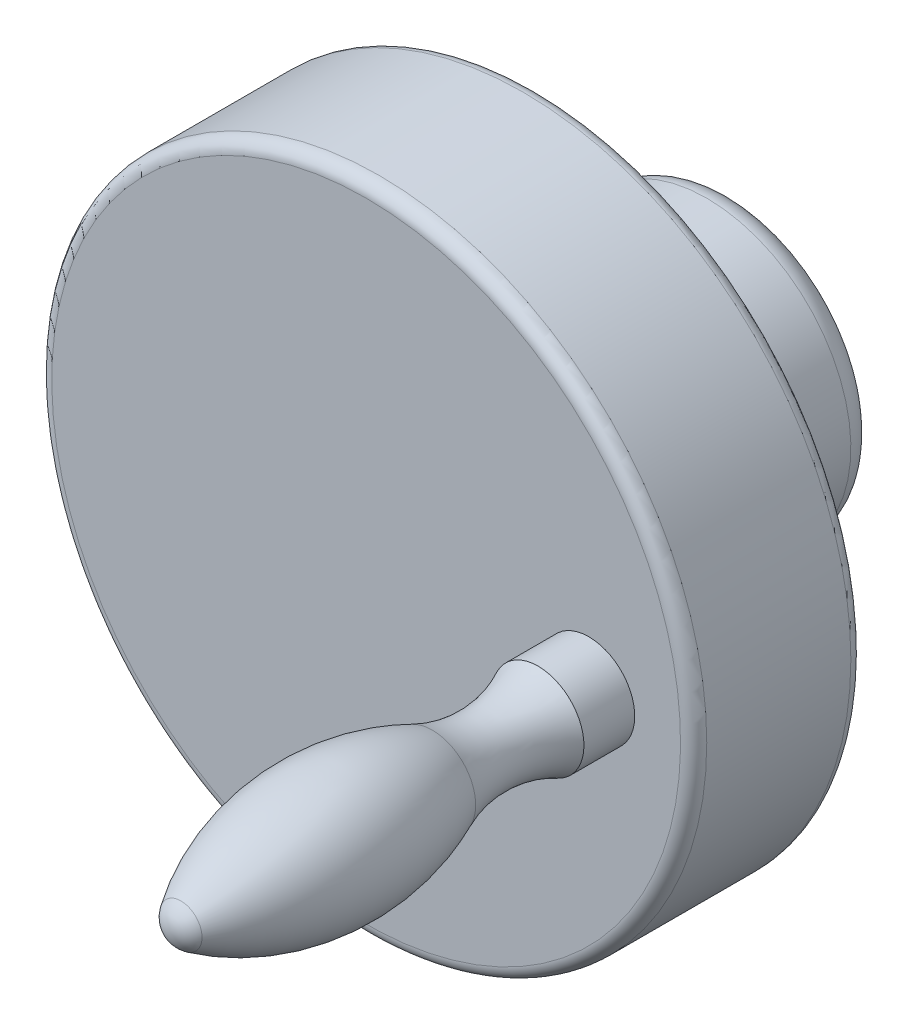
ISO-10303-21;
HEADER;
FILE_DESCRIPTION(('STEP AP214'),'2;1');
FILE_NAME('part.step','',(''),(''),'','','');
FILE_SCHEMA(('AUTOMOTIVE_DESIGN { 1 0 10303 214 1 1 1 1 }'));
ENDSEC;
DATA;
#1=APPLICATION_CONTEXT('core data for automotive mechanical design processes');
#2=APPLICATION_PROTOCOL_DEFINITION('international standard','automotive_design',2000,#1);
#3=PRODUCT_CONTEXT('',#1,'mechanical');
#4=PRODUCT('Part','Part','',(#3));
#5=PRODUCT_RELATED_PRODUCT_CATEGORY('part','',(#4));
#6=PRODUCT_DEFINITION_FORMATION('','',#4);
#7=PRODUCT_DEFINITION_CONTEXT('part definition',#1,'design');
#8=PRODUCT_DEFINITION('design','',#6,#7);
#9=PRODUCT_DEFINITION_SHAPE('','',#8);
#10=(LENGTH_UNIT() NAMED_UNIT(*) SI_UNIT(.MILLI.,.METRE.));
#11=(NAMED_UNIT(*) PLANE_ANGLE_UNIT() SI_UNIT($,.RADIAN.));
#12=(NAMED_UNIT(*) SI_UNIT($,.STERADIAN.) SOLID_ANGLE_UNIT());
#13=UNCERTAINTY_MEASURE_WITH_UNIT(LENGTH_MEASURE(1.E-05),#10,'distance_accuracy_value','');
#14=(GEOMETRIC_REPRESENTATION_CONTEXT(3) GLOBAL_UNCERTAINTY_ASSIGNED_CONTEXT((#13)) GLOBAL_UNIT_ASSIGNED_CONTEXT((#10,
#11,#12)) REPRESENTATION_CONTEXT('',''));
#15=CARTESIAN_POINT('',(0.,0.,0.));
#16=DIRECTION('',(0.,0.,1.));
#17=DIRECTION('',(1.,0.,0.));
#18=AXIS2_PLACEMENT_3D('',#15,#16,#17);
#19=CARTESIAN_POINT('',(0.,0.,33.));
#20=DIRECTION('',(0.,0.,1.));
#21=DIRECTION('',(0.,1.,0.));
#22=AXIS2_PLACEMENT_3D('',#19,#20,#21);
#23=CYLINDRICAL_SURFACE('',#22,2.5);
#24=CARTESIAN_POINT('',(0.,0.,0.));
#25=DIRECTION('',(0.,0.,1.));
#26=DIRECTION('',(0.,1.,0.));
#27=AXIS2_PLACEMENT_3D('',#24,#25,#26);
#28=CIRCLE('',#27,2.5);
#29=CARTESIAN_POINT('',(0.,2.5,0.));
#30=VERTEX_POINT('',#29);
#31=EDGE_CURVE('E46',#30,#30,#28,.T.);
#32=ORIENTED_EDGE('',*,*,#31,.F.);
#33=EDGE_LOOP('',(#32));
#34=FACE_BOUND('',#33,.T.);
#35=CARTESIAN_POINT('',(0.,0.,15.));
#36=DIRECTION('',(0.,0.,-1.));
#37=DIRECTION('',(0.,1.,0.));
#38=AXIS2_PLACEMENT_3D('',#35,#36,#37);
#39=CIRCLE('',#38,2.5);
#40=CARTESIAN_POINT('',(0.,2.5,15.));
#41=VERTEX_POINT('',#40);
#42=EDGE_CURVE('E58',#41,#41,#39,.T.);
#43=ORIENTED_EDGE('',*,*,#42,.F.);
#44=EDGE_LOOP('',(#43));
#45=FACE_BOUND('',#44,.T.);
#46=ADVANCED_FACE('F12',(#34,#45),#23,.F.);
#47=CARTESIAN_POINT('',(0.,0.,28.));
#48=DIRECTION('',(0.,0.,1.));
#49=DIRECTION('',(0.,1.,0.));
#50=AXIS2_PLACEMENT_3D('',#47,#48,#49);
#51=PLANE('',#50);
#52=CARTESIAN_POINT('',(17.,0.,28.));
#53=DIRECTION('',(0.,0.,1.));
#54=DIRECTION('',(0.,1.,0.));
#55=AXIS2_PLACEMENT_3D('',#52,#53,#54);
#56=CIRCLE('',#55,3.5017935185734);
#57=CARTESIAN_POINT('',(17.,3.5017935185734,28.));
#58=VERTEX_POINT('',#57);
#59=EDGE_CURVE('E8',#58,#58,#56,.T.);
#60=ORIENTED_EDGE('',*,*,#59,.F.);
#61=EDGE_LOOP('',(#60));
#62=FACE_BOUND('',#61,.T.);
#63=CARTESIAN_POINT('',(0.,0.,28.));
#64=DIRECTION('',(0.,0.,1.));
#65=DIRECTION('',(0.,1.,0.));
#66=AXIS2_PLACEMENT_3D('',#63,#64,#65);
#67=CIRCLE('',#66,24.);
#68=CARTESIAN_POINT('',(0.,24.,28.));
#69=VERTEX_POINT('',#68);
#70=EDGE_CURVE('E18',#69,#69,#67,.T.);
#71=ORIENTED_EDGE('',*,*,#70,.T.);
#72=EDGE_LOOP('',(#71));
#73=FACE_BOUND('',#72,.T.);
#74=ADVANCED_FACE('F65',(#62,#73),#51,.T.);
#75=CARTESIAN_POINT('',(0.,0.,27.));
#76=DIRECTION('',(0.,0.,1.));
#77=DIRECTION('',(0.,1.,0.));
#78=AXIS2_PLACEMENT_3D('',#75,#76,#77);
#79=TOROIDAL_SURFACE('',#78,24.,1.);
#80=CARTESIAN_POINT('',(0.,0.,27.));
#81=DIRECTION('',(0.,0.,1.));
#82=DIRECTION('',(0.,1.,0.));
#83=AXIS2_PLACEMENT_3D('',#80,#81,#82);
#84=CIRCLE('',#83,25.);
#85=CARTESIAN_POINT('',(0.,25.,27.));
#86=VERTEX_POINT('',#85);
#87=EDGE_CURVE('E22',#86,#86,#84,.T.);
#88=ORIENTED_EDGE('',*,*,#87,.T.);
#89=EDGE_LOOP('',(#88));
#90=FACE_BOUND('',#89,.T.);
#91=ORIENTED_EDGE('',*,*,#70,.F.);
#92=EDGE_LOOP('',(#91));
#93=FACE_BOUND('',#92,.T.);
#94=ADVANCED_FACE('F71',(#90,#93),#79,.T.);
#95=CARTESIAN_POINT('',(0.,0.,33.));
#96=DIRECTION('',(0.,0.,1.));
#97=DIRECTION('',(0.,1.,0.));
#98=AXIS2_PLACEMENT_3D('',#95,#96,#97);
#99=CYLINDRICAL_SURFACE('',#98,25.);
#100=CARTESIAN_POINT('',(0.,0.,16.));
#101=DIRECTION('',(0.,0.,1.));
#102=DIRECTION('',(0.,1.,0.));
#103=AXIS2_PLACEMENT_3D('',#100,#101,#102);
#104=CIRCLE('',#103,25.);
#105=CARTESIAN_POINT('',(0.,25.,16.));
#106=VERTEX_POINT('',#105);
#107=EDGE_CURVE('E26',#106,#106,#104,.T.);
#108=ORIENTED_EDGE('',*,*,#107,.T.);
#109=EDGE_LOOP('',(#108));
#110=FACE_BOUND('',#109,.T.);
#111=ORIENTED_EDGE('',*,*,#87,.F.);
#112=EDGE_LOOP('',(#111));
#113=FACE_BOUND('',#112,.T.);
#114=ADVANCED_FACE('F108',(#110,#113),#99,.T.);
#115=CARTESIAN_POINT('',(0.,0.,16.));
#116=DIRECTION('',(0.,0.,1.));
#117=DIRECTION('',(0.,1.,0.));
#118=AXIS2_PLACEMENT_3D('',#115,#116,#117);
#119=TOROIDAL_SURFACE('',#118,24.,1.);
#120=CARTESIAN_POINT('',(0.,0.,15.));
#121=DIRECTION('',(0.,0.,1.));
#122=DIRECTION('',(0.,1.,0.));
#123=AXIS2_PLACEMENT_3D('',#120,#121,#122);
#124=CIRCLE('',#123,24.);
#125=CARTESIAN_POINT('',(0.,24.,15.));
#126=VERTEX_POINT('',#125);
#127=EDGE_CURVE('E31',#126,#126,#124,.T.);
#128=ORIENTED_EDGE('',*,*,#127,.T.);
#129=EDGE_LOOP('',(#128));
#130=FACE_BOUND('',#129,.T.);
#131=ORIENTED_EDGE('',*,*,#107,.F.);
#132=EDGE_LOOP('',(#131));
#133=FACE_BOUND('',#132,.T.);
#134=ADVANCED_FACE('F104',(#130,#133),#119,.T.);
#135=CARTESIAN_POINT('',(14.,0.,15.));
#136=DIRECTION('',(0.,0.,1.));
#137=DIRECTION('',(0.,1.,0.));
#138=AXIS2_PLACEMENT_3D('',#135,#136,#137);
#139=PLANE('',#138);
#140=ORIENTED_EDGE('',*,*,#127,.F.);
#141=EDGE_LOOP('',(#140));
#142=FACE_BOUND('',#141,.T.);
#143=CARTESIAN_POINT('',(0.,0.,15.));
#144=DIRECTION('',(0.,0.,1.));
#145=DIRECTION('',(0.,1.,0.));
#146=AXIS2_PLACEMENT_3D('',#143,#144,#145);
#147=CIRCLE('',#146,14.);
#148=CARTESIAN_POINT('',(0.,14.,15.));
#149=VERTEX_POINT('',#148);
#150=EDGE_CURVE('E34',#149,#149,#147,.T.);
#151=ORIENTED_EDGE('',*,*,#150,.T.);
#152=EDGE_LOOP('',(#151));
#153=FACE_BOUND('',#152,.T.);
#154=ADVANCED_FACE('F100',(#142,#153),#139,.F.);
#155=CARTESIAN_POINT('',(0.,0.,12.));
#156=DIRECTION('',(0.,0.,1.));
#157=DIRECTION('',(0.,1.,0.));
#158=AXIS2_PLACEMENT_3D('',#155,#156,#157);
#159=TOROIDAL_SURFACE('',#158,14.,3.);
#160=ORIENTED_EDGE('',*,*,#150,.F.);
#161=EDGE_LOOP('',(#160));
#162=FACE_BOUND('',#161,.T.);
#163=CARTESIAN_POINT('',(0.,0.,12.));
#164=DIRECTION('',(0.,0.,1.));
#165=DIRECTION('',(0.,1.,0.));
#166=AXIS2_PLACEMENT_3D('',#163,#164,#165);
#167=CIRCLE('',#166,11.);
#168=CARTESIAN_POINT('',(0.,11.,12.));
#169=VERTEX_POINT('',#168);
#170=EDGE_CURVE('E37',#169,#169,#167,.T.);
#171=ORIENTED_EDGE('',*,*,#170,.T.);
#172=EDGE_LOOP('',(#171));
#173=FACE_BOUND('',#172,.T.);
#174=ADVANCED_FACE('F96',(#162,#173),#159,.F.);
#175=CARTESIAN_POINT('',(0.,0.,33.));
#176=DIRECTION('',(0.,0.,1.));
#177=DIRECTION('',(0.,1.,0.));
#178=AXIS2_PLACEMENT_3D('',#175,#176,#177);
#179=CYLINDRICAL_SURFACE('',#178,11.);
#180=CARTESIAN_POINT('',(0.,0.,2.));
#181=DIRECTION('',(0.,0.,1.));
#182=DIRECTION('',(0.,1.,0.));
#183=AXIS2_PLACEMENT_3D('',#180,#181,#182);
#184=CIRCLE('',#183,11.);
#185=CARTESIAN_POINT('',(0.,11.,2.));
#186=VERTEX_POINT('',#185);
#187=EDGE_CURVE('E40',#186,#186,#184,.T.);
#188=ORIENTED_EDGE('',*,*,#187,.T.);
#189=EDGE_LOOP('',(#188));
#190=FACE_BOUND('',#189,.T.);
#191=ORIENTED_EDGE('',*,*,#170,.F.);
#192=EDGE_LOOP('',(#191));
#193=FACE_BOUND('',#192,.T.);
#194=ADVANCED_FACE('F88',(#190,#193),#179,.T.);
#195=CARTESIAN_POINT('',(0.,0.,2.));
#196=DIRECTION('',(0.,0.,1.));
#197=DIRECTION('',(0.,1.,0.));
#198=AXIS2_PLACEMENT_3D('',#195,#196,#197);
#199=TOROIDAL_SURFACE('',#198,9.,2.);
#200=CARTESIAN_POINT('',(0.,0.,0.));
#201=DIRECTION('',(0.,0.,1.));
#202=DIRECTION('',(0.,1.,0.));
#203=AXIS2_PLACEMENT_3D('',#200,#201,#202);
#204=CIRCLE('',#203,9.);
#205=CARTESIAN_POINT('',(0.,9.,0.));
#206=VERTEX_POINT('',#205);
#207=EDGE_CURVE('E43',#206,#206,#204,.T.);
#208=ORIENTED_EDGE('',*,*,#207,.T.);
#209=EDGE_LOOP('',(#208));
#210=FACE_BOUND('',#209,.T.);
#211=ORIENTED_EDGE('',*,*,#187,.F.);
#212=EDGE_LOOP('',(#211));
#213=FACE_BOUND('',#212,.T.);
#214=ADVANCED_FACE('F78',(#210,#213),#199,.T.);
#215=CARTESIAN_POINT('',(2.5,0.,0.));
#216=DIRECTION('',(0.,0.,1.));
#217=DIRECTION('',(0.,1.,0.));
#218=AXIS2_PLACEMENT_3D('',#215,#216,#217);
#219=PLANE('',#218);
#220=ORIENTED_EDGE('',*,*,#207,.F.);
#221=EDGE_LOOP('',(#220));
#222=FACE_BOUND('',#221,.T.);
#223=ORIENTED_EDGE('',*,*,#31,.T.);
#224=EDGE_LOOP('',(#223));
#225=FACE_BOUND('',#224,.T.);
#226=ADVANCED_FACE('F75',(#222,#225),#219,.F.);
#227=CARTESIAN_POINT('',(17.,0.,36.1211991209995));
#228=DIRECTION('',(0.,0.,1.));
#229=DIRECTION('',(0.,1.,0.));
#230=AXIS2_PLACEMENT_3D('',#227,#228,#229);
#231=TOROIDAL_SURFACE('',#230,12.0017935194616,9.50000006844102);
#232=CARTESIAN_POINT('',(17.,0.,39.9472159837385));
#233=DIRECTION('',(0.,0.,1.));
#234=DIRECTION('',(0.,1.,0.));
#235=AXIS2_PLACEMENT_3D('',#232,#233,#234);
#236=CIRCLE('',#235,3.30630064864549);
#237=CARTESIAN_POINT('',(17.,3.30630064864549,39.9472159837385));
#238=VERTEX_POINT('',#237);
#239=EDGE_CURVE('E55',#238,#238,#236,.T.);
#240=ORIENTED_EDGE('',*,*,#239,.F.);
#241=EDGE_LOOP('',(#240));
#242=FACE_BOUND('',#241,.T.);
#243=CARTESIAN_POINT('',(17.,0.,31.878558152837));
#244=DIRECTION('',(0.,0.,1.));
#245=DIRECTION('',(0.,1.,0.));
#246=AXIS2_PLACEMENT_3D('',#243,#244,#245);
#247=CIRCLE('',#246,3.50179358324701);
#248=CARTESIAN_POINT('',(17.,3.50179358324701,31.878558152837));
#249=VERTEX_POINT('',#248);
#250=EDGE_CURVE('E49',#249,#249,#247,.T.);
#251=ORIENTED_EDGE('',*,*,#250,.T.);
#252=EDGE_LOOP('',(#251));
#253=FACE_BOUND('',#252,.T.);
#254=ADVANCED_FACE('F77',(#242,#253),#231,.F.);
#255=CARTESIAN_POINT('',(17.,0.,65.));
#256=DIRECTION('',(0.,0.,1.));
#257=DIRECTION('',(0.,1.,0.));
#258=AXIS2_PLACEMENT_3D('',#255,#256,#257);
#259=CYLINDRICAL_SURFACE('',#258,3.5017935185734);
#260=ORIENTED_EDGE('',*,*,#59,.T.);
#261=EDGE_LOOP('',(#260));
#262=FACE_BOUND('',#261,.T.);
#263=ORIENTED_EDGE('',*,*,#250,.F.);
#264=EDGE_LOOP('',(#263));
#265=FACE_BOUND('',#264,.T.);
#266=ADVANCED_FACE('F85',(#262,#265),#259,.T.);
#267=CARTESIAN_POINT('',(17.,0.,58.06));
#268=DIRECTION('',(0.,1.,0.));
#269=DIRECTION('',(0.,0.,-1.));
#270=AXIS2_PLACEMENT_3D('',#267,#268,#269);
#271=SPHERICAL_SURFACE('',#270,1.93999999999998);
#272=CARTESIAN_POINT('',(17.,0.,58.06));
#273=DIRECTION('',(0.,0.,1.));
#274=DIRECTION('',(0.,1.,0.));
#275=AXIS2_PLACEMENT_3D('',#272,#273,#274);
#276=SPHERICAL_SURFACE('',#275,1.93999999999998);
#277=CARTESIAN_POINT('',(17.,0.,59.1404287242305));
#278=DIRECTION('',(0.,0.,1.));
#279=DIRECTION('',(0.,1.,0.));
#280=AXIS2_PLACEMENT_3D('',#277,#278,#279);
#281=CIRCLE('',#280,1.61129568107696);
#282=CARTESIAN_POINT('',(17.,1.61129568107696,59.1404287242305));
#283=VERTEX_POINT('',#282);
#284=EDGE_CURVE('E52',#283,#283,#281,.T.);
#285=ORIENTED_EDGE('',*,*,#284,.T.);
#286=EDGE_LOOP('',(#285));
#287=FACE_BOUND('',#286,.T.);
#288=ADVANCED_FACE('F170',(#287),#276,.T.);
#289=CARTESIAN_POINT('',(17.,0.,48.0019882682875));
#290=DIRECTION('',(0.,0.,1.));
#291=DIRECTION('',(0.,1.,0.));
#292=AXIS2_PLACEMENT_3D('',#289,#290,#291);
#293=DEGENERATE_TOROIDAL_SURFACE('',#292,15.0000000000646,19.9999999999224,.F.);
#294=ORIENTED_EDGE('',*,*,#239,.T.);
#295=EDGE_LOOP('',(#294));
#296=FACE_BOUND('',#295,.T.);
#297=ORIENTED_EDGE('',*,*,#284,.F.);
#298=EDGE_LOOP('',(#297));
#299=FACE_BOUND('',#298,.T.);
#300=ADVANCED_FACE('F178',(#296,#299),#293,.F.);
#301=CARTESIAN_POINT('',(0.,0.,15.));
#302=DIRECTION('',(0.,0.,-1.));
#303=DIRECTION('',(0.,1.,0.));
#304=AXIS2_PLACEMENT_3D('',#301,#302,#303);
#305=PLANE('',#304);
#306=ORIENTED_EDGE('',*,*,#42,.T.);
#307=EDGE_LOOP('',(#306));
#308=FACE_BOUND('',#307,.T.);
#309=ADVANCED_FACE('F62',(#308),#305,.T.);
#310=CLOSED_SHELL('',(#46,#74,#94,#114,#134,#154,#174,#194,#214,#226,#254,#266,#288,#300,#309));
#311=MANIFOLD_SOLID_BREP('B1',#310);
#312=ADVANCED_BREP_SHAPE_REPRESENTATION('',(#18,#311),#14);
#313=SHAPE_DEFINITION_REPRESENTATION(#9,#312);
ENDSEC;
END-ISO-10303-21;
